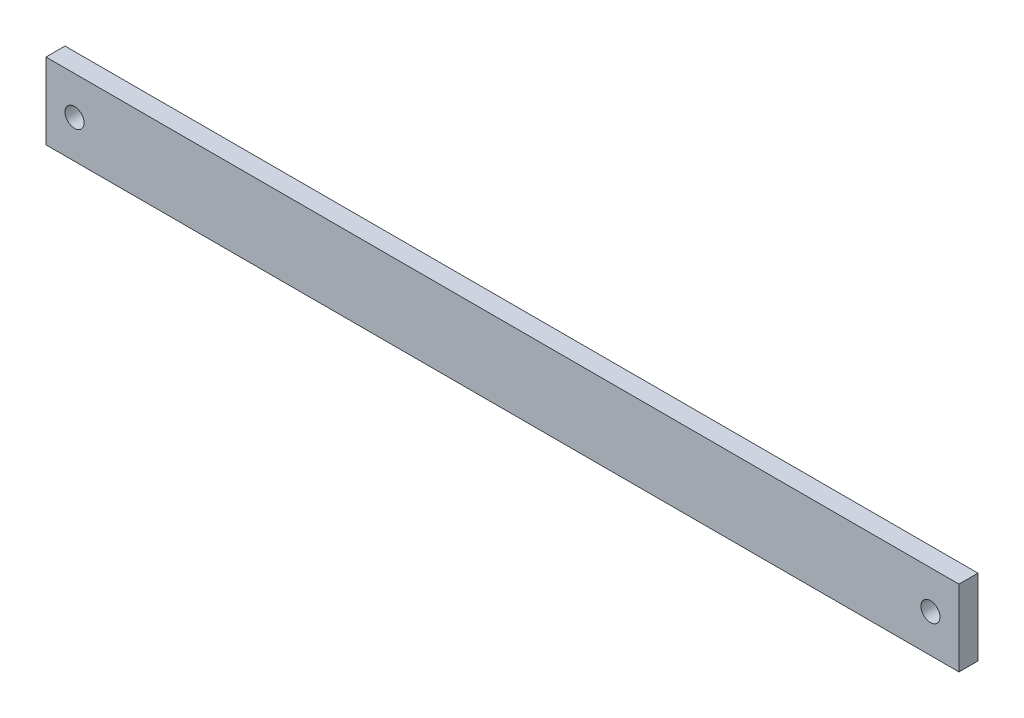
from build123d import *

# Parameters (mm, degrees)
SKETCH1_W          = 304.8
SKETCH1_H          = 25.4
EXTRUDE1_DEPTH     = 6.35
SKETCH2_R          = 3.175
CUT_EXTRUDE1_DEPTH = 344.678167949


with BuildPart() as part:
    # Sketch1 → Extrude1 (new body)
    with BuildSketch(Plane.XY):
        with Locations((0, 295.275)):
            Rectangle(SKETCH1_W, SKETCH1_H)
    extrude(amount=EXTRUDE1_DEPTH)

    # Sketch2 → Cut-Extrude1 (cut, through all)
    with BuildSketch(Plane.XY.offset(6.35)):
        with Locations((142.875, 295.275)):
            Circle(SKETCH2_R)
        with Locations(Location((-142.875, 295.275, 0), (0, 0, 180))):
            Circle(SKETCH2_R)
    extrude(amount=-CUT_EXTRUDE1_DEPTH, mode=Mode.SUBTRACT)


solid = part.part
